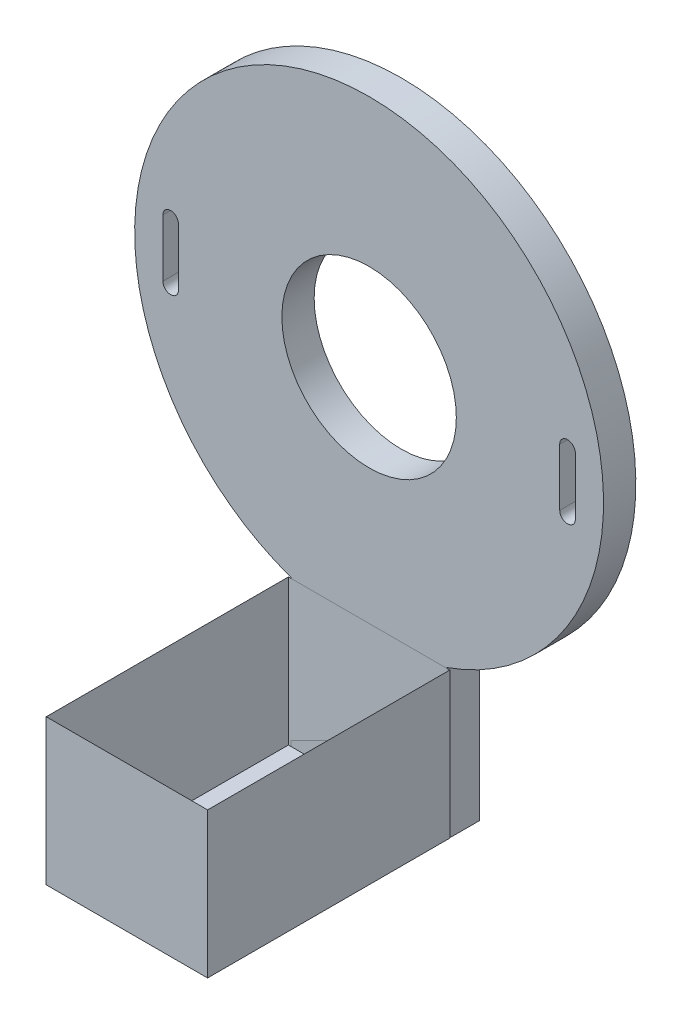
ISO-10303-21;
HEADER;
FILE_DESCRIPTION(('STEP AP214'),'2;1');
FILE_NAME('part.step','',(''),(''),'','','');
FILE_SCHEMA(('AUTOMOTIVE_DESIGN { 1 0 10303 214 1 1 1 1 }'));
ENDSEC;
DATA;
#1=APPLICATION_CONTEXT('core data for automotive mechanical design processes');
#2=APPLICATION_PROTOCOL_DEFINITION('international standard','automotive_design',2000,#1);
#3=PRODUCT_CONTEXT('',#1,'mechanical');
#4=PRODUCT('Part','Part','',(#3));
#5=PRODUCT_RELATED_PRODUCT_CATEGORY('part','',(#4));
#6=PRODUCT_DEFINITION_FORMATION('','',#4);
#7=PRODUCT_DEFINITION_CONTEXT('part definition',#1,'design');
#8=PRODUCT_DEFINITION('design','',#6,#7);
#9=PRODUCT_DEFINITION_SHAPE('','',#8);
#10=(LENGTH_UNIT() NAMED_UNIT(*) SI_UNIT(.MILLI.,.METRE.));
#11=(NAMED_UNIT(*) PLANE_ANGLE_UNIT() SI_UNIT($,.RADIAN.));
#12=(NAMED_UNIT(*) SI_UNIT($,.STERADIAN.) SOLID_ANGLE_UNIT());
#13=UNCERTAINTY_MEASURE_WITH_UNIT(LENGTH_MEASURE(1.E-05),#10,'distance_accuracy_value','');
#14=(GEOMETRIC_REPRESENTATION_CONTEXT(3) GLOBAL_UNCERTAINTY_ASSIGNED_CONTEXT((#13)) GLOBAL_UNIT_ASSIGNED_CONTEXT((#10,
#11,#12)) REPRESENTATION_CONTEXT('',''));
#15=CARTESIAN_POINT('',(0.,0.,0.));
#16=DIRECTION('',(0.,0.,1.));
#17=DIRECTION('',(1.,0.,0.));
#18=AXIS2_PLACEMENT_3D('',#15,#16,#17);
#19=CARTESIAN_POINT('',(0.,-0.00286743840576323,1.5748));
#20=DIRECTION('',(0.,0.,1.));
#21=DIRECTION('',(1.,0.,0.));
#22=AXIS2_PLACEMENT_3D('',#19,#20,#21);
#23=PLANE('',#22);
#24=CARTESIAN_POINT('',(1.27,-13.6144,1.5748));
#25=DIRECTION('',(0.,0.,-1.));
#26=DIRECTION('',(-1.,0.,0.));
#27=AXIS2_PLACEMENT_3D('',#24,#25,#26);
#28=CIRCLE('',#27,0.5461);
#29=CARTESIAN_POINT('',(0.7239,-13.6144,1.5748));
#30=VERTEX_POINT('',#29);
#31=EDGE_CURVE('P0_E155',#30,#30,#28,.T.);
#32=ORIENTED_EDGE('',*,*,#31,.T.);
#33=EDGE_LOOP('',(#32));
#34=FACE_BOUND('',#33,.T.);
#35=CARTESIAN_POINT('',(0.,0.,1.5748));
#36=DIRECTION('',(0.,0.,-1.));
#37=DIRECTION('',(-1.,0.,0.));
#38=AXIS2_PLACEMENT_3D('',#35,#36,#37);
#39=CIRCLE('',#38,4.2545);
#40=CARTESIAN_POINT('',(-4.2545,0.,1.5748));
#41=VERTEX_POINT('',#40);
#42=EDGE_CURVE('P0_E166',#41,#41,#39,.T.);
#43=ORIENTED_EDGE('',*,*,#42,.T.);
#44=EDGE_LOOP('',(#43));
#45=FACE_BOUND('',#44,.T.);
#46=DIRECTION('',(1.,0.,0.));
#47=VECTOR('',#46,1.);
#48=CARTESIAN_POINT('',(-3.81,-18.034,1.5748));
#49=LINE('',#48,#47);
#50=CARTESIAN_POINT('',(-3.81,-18.034,1.5748));
#51=VERTEX_POINT('',#50);
#52=CARTESIAN_POINT('',(3.81,-18.034,1.5748));
#53=VERTEX_POINT('',#52);
#54=EDGE_CURVE('P0_E188',#51,#53,#49,.T.);
#55=ORIENTED_EDGE('',*,*,#54,.T.);
#56=DIRECTION('',(0.,1.,0.));
#57=VECTOR('',#56,1.);
#58=CARTESIAN_POINT('',(3.81,-18.034,1.5748));
#59=LINE('',#58,#57);
#60=CARTESIAN_POINT('',(3.81,-10.7823,1.5748));
#61=VERTEX_POINT('',#60);
#62=EDGE_CURVE('P0_E172',#53,#61,#59,.T.);
#63=ORIENTED_EDGE('',*,*,#62,.T.);
#64=CARTESIAN_POINT('',(0.,-0.00286743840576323,1.5748));
#65=DIRECTION('',(0.,0.,-1.));
#66=DIRECTION('',(-1.,0.,0.));
#67=AXIS2_PLACEMENT_3D('',#64,#65,#66);
#68=CIRCLE('',#67,11.4329465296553);
#69=CARTESIAN_POINT('',(-3.81,-10.7823,1.5748));
#70=VERTEX_POINT('',#69);
#71=EDGE_CURVE('P0_E170',#70,#61,#68,.T.);
#72=ORIENTED_EDGE('',*,*,#71,.F.);
#73=DIRECTION('',(0.,1.,0.));
#74=VECTOR('',#73,1.);
#75=CARTESIAN_POINT('',(-3.81,-10.7823,1.5748));
#76=LINE('',#75,#74);
#77=EDGE_CURVE('P0_E122',#70,#51,#76,.F.);
#78=ORIENTED_EDGE('',*,*,#77,.T.);
#79=EDGE_LOOP('',(#55,#63,#72,#78));
#80=FACE_BOUND('',#79,.T.);
#81=CARTESIAN_POINT('',(-1.27,-13.6144,1.5748));
#82=DIRECTION('',(0.,0.,-1.));
#83=DIRECTION('',(-1.,0.,0.));
#84=AXIS2_PLACEMENT_3D('',#81,#82,#83);
#85=CIRCLE('',#84,0.5461);
#86=CARTESIAN_POINT('',(-1.8161,-13.6144,1.5748));
#87=VERTEX_POINT('',#86);
#88=EDGE_CURVE('P0_E20',#87,#87,#85,.T.);
#89=ORIENTED_EDGE('',*,*,#88,.T.);
#90=EDGE_LOOP('',(#89));
#91=FACE_BOUND('',#90,.T.);
#92=CARTESIAN_POINT('',(9.6774,-1.397,1.5748));
#93=DIRECTION('',(0.,0.,-1.));
#94=DIRECTION('',(-1.,0.,0.));
#95=AXIS2_PLACEMENT_3D('',#92,#93,#94);
#96=CIRCLE('',#95,0.381000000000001);
#97=CARTESIAN_POINT('',(10.0584,-1.397,1.5748));
#98=VERTEX_POINT('',#97);
#99=CARTESIAN_POINT('',(9.2964,-1.397,1.5748));
#100=VERTEX_POINT('',#99);
#101=EDGE_CURVE('P0_E163',#98,#100,#96,.T.);
#102=ORIENTED_EDGE('',*,*,#101,.T.);
#103=DIRECTION('',(0.,1.,0.));
#104=VECTOR('',#103,1.);
#105=CARTESIAN_POINT('',(9.2964,1.397,1.5748));
#106=LINE('',#105,#104);
#107=CARTESIAN_POINT('',(9.2964,1.397,1.5748));
#108=VERTEX_POINT('',#107);
#109=EDGE_CURVE('P0_E181',#100,#108,#106,.T.);
#110=ORIENTED_EDGE('',*,*,#109,.T.);
#111=CARTESIAN_POINT('',(9.6774,1.397,1.5748));
#112=DIRECTION('',(0.,0.,-1.));
#113=DIRECTION('',(-1.,0.,0.));
#114=AXIS2_PLACEMENT_3D('',#111,#112,#113);
#115=CIRCLE('',#114,0.381000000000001);
#116=CARTESIAN_POINT('',(10.0584,1.397,1.5748));
#117=VERTEX_POINT('',#116);
#118=EDGE_CURVE('P0_E159',#108,#117,#115,.T.);
#119=ORIENTED_EDGE('',*,*,#118,.T.);
#120=DIRECTION('',(0.,1.,0.));
#121=VECTOR('',#120,1.);
#122=CARTESIAN_POINT('',(10.0584,1.397,1.5748));
#123=LINE('',#122,#121);
#124=EDGE_CURVE('P0_E158',#117,#98,#123,.F.);
#125=ORIENTED_EDGE('',*,*,#124,.T.);
#126=EDGE_LOOP('',(#102,#110,#119,#125));
#127=FACE_BOUND('',#126,.T.);
#128=CARTESIAN_POINT('',(-9.6774,-1.397,1.5748));
#129=DIRECTION('',(0.,0.,-1.));
#130=DIRECTION('',(-1.,0.,0.));
#131=AXIS2_PLACEMENT_3D('',#128,#129,#130);
#132=CIRCLE('',#131,0.381000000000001);
#133=CARTESIAN_POINT('',(-9.2964,-1.397,1.5748));
#134=VERTEX_POINT('',#133);
#135=CARTESIAN_POINT('',(-10.0584,-1.397,1.5748));
#136=VERTEX_POINT('',#135);
#137=EDGE_CURVE('P0_E98',#134,#136,#132,.T.);
#138=ORIENTED_EDGE('',*,*,#137,.T.);
#139=DIRECTION('',(0.,1.,0.));
#140=VECTOR('',#139,1.);
#141=CARTESIAN_POINT('',(-10.0584,1.397,1.5748));
#142=LINE('',#141,#140);
#143=CARTESIAN_POINT('',(-10.0584,1.397,1.5748));
#144=VERTEX_POINT('',#143);
#145=EDGE_CURVE('P0_E129',#136,#144,#142,.T.);
#146=ORIENTED_EDGE('',*,*,#145,.T.);
#147=CARTESIAN_POINT('',(-9.6774,1.397,1.5748));
#148=DIRECTION('',(0.,0.,-1.));
#149=DIRECTION('',(-1.,0.,0.));
#150=AXIS2_PLACEMENT_3D('',#147,#148,#149);
#151=CIRCLE('',#150,0.381000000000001);
#152=CARTESIAN_POINT('',(-9.2964,1.397,1.5748));
#153=VERTEX_POINT('',#152);
#154=EDGE_CURVE('P0_E116',#144,#153,#151,.T.);
#155=ORIENTED_EDGE('',*,*,#154,.T.);
#156=DIRECTION('',(0.,1.,0.));
#157=VECTOR('',#156,1.);
#158=CARTESIAN_POINT('',(-9.2964,1.397,1.5748));
#159=LINE('',#158,#157);
#160=EDGE_CURVE('P0_E111',#153,#134,#159,.F.);
#161=ORIENTED_EDGE('',*,*,#160,.T.);
#162=EDGE_LOOP('',(#138,#146,#155,#161));
#163=FACE_BOUND('',#162,.T.);
#164=ADVANCED_FACE('P0_F17',(#34,#45,#80,#91,#127,#163),#23,.T.);
#165=CARTESIAN_POINT('',(-1.27,-13.6144,1.5748));
#166=DIRECTION('',(0.,0.,-1.));
#167=DIRECTION('',(-1.,0.,0.));
#168=AXIS2_PLACEMENT_3D('',#165,#166,#167);
#169=CYLINDRICAL_SURFACE('',#168,0.5461);
#170=CARTESIAN_POINT('',(-1.27,-13.6144,0.));
#171=DIRECTION('',(0.,0.,-1.));
#172=DIRECTION('',(-1.,0.,0.));
#173=AXIS2_PLACEMENT_3D('',#170,#171,#172);
#174=CIRCLE('',#173,0.5461);
#175=CARTESIAN_POINT('',(-1.8161,-13.6144,0.));
#176=VERTEX_POINT('',#175);
#177=EDGE_CURVE('P0_E152',#176,#176,#174,.T.);
#178=ORIENTED_EDGE('',*,*,#177,.T.);
#179=EDGE_LOOP('',(#178));
#180=FACE_BOUND('',#179,.T.);
#181=ORIENTED_EDGE('',*,*,#88,.F.);
#182=EDGE_LOOP('',(#181));
#183=FACE_BOUND('',#182,.T.);
#184=ADVANCED_FACE('P0_F251',(#180,#183),#169,.F.);
#185=CARTESIAN_POINT('',(-9.6774,-1.397,1.5748));
#186=DIRECTION('',(0.,0.,-1.));
#187=DIRECTION('',(-1.,0.,0.));
#188=AXIS2_PLACEMENT_3D('',#185,#186,#187);
#189=CYLINDRICAL_SURFACE('',#188,0.381000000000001);
#190=DIRECTION('',(0.,0.,1.));
#191=VECTOR('',#190,1.);
#192=CARTESIAN_POINT('',(-10.0584,-1.397,1.5748));
#193=LINE('',#192,#191);
#194=CARTESIAN_POINT('',(-10.0584,-1.397,0.));
#195=VERTEX_POINT('',#194);
#196=EDGE_CURVE('P0_E104',#195,#136,#193,.T.);
#197=ORIENTED_EDGE('',*,*,#196,.T.);
#198=ORIENTED_EDGE('',*,*,#137,.F.);
#199=DIRECTION('',(0.,0.,-1.));
#200=VECTOR('',#199,1.);
#201=CARTESIAN_POINT('',(-9.2964,-1.397,1.5748));
#202=LINE('',#201,#200);
#203=CARTESIAN_POINT('',(-9.2964,-1.397,0.));
#204=VERTEX_POINT('',#203);
#205=EDGE_CURVE('P0_E102',#134,#204,#202,.T.);
#206=ORIENTED_EDGE('',*,*,#205,.T.);
#207=CARTESIAN_POINT('',(-9.6774,-1.397,0.));
#208=DIRECTION('',(0.,0.,-1.));
#209=DIRECTION('',(-1.,0.,0.));
#210=AXIS2_PLACEMENT_3D('',#207,#208,#209);
#211=CIRCLE('',#210,0.381000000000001);
#212=EDGE_CURVE('P0_E150',#204,#195,#211,.T.);
#213=ORIENTED_EDGE('',*,*,#212,.T.);
#214=EDGE_LOOP('',(#197,#198,#206,#213));
#215=FACE_BOUND('',#214,.T.);
#216=ADVANCED_FACE('P0_F100',(#215),#189,.F.);
#217=CARTESIAN_POINT('',(-10.0584,1.397,1.5748));
#218=DIRECTION('',(-1.,0.,0.));
#219=DIRECTION('',(0.,0.,1.));
#220=AXIS2_PLACEMENT_3D('',#217,#218,#219);
#221=PLANE('',#220);
#222=ORIENTED_EDGE('',*,*,#196,.F.);
#223=DIRECTION('',(0.,1.,0.));
#224=VECTOR('',#223,1.);
#225=CARTESIAN_POINT('',(-10.0584,-0.00286743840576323,0.));
#226=LINE('',#225,#224);
#227=CARTESIAN_POINT('',(-10.0584,1.397,0.));
#228=VERTEX_POINT('',#227);
#229=EDGE_CURVE('P0_E149',#195,#228,#226,.T.);
#230=ORIENTED_EDGE('',*,*,#229,.T.);
#231=DIRECTION('',(0.,0.,-1.));
#232=VECTOR('',#231,1.);
#233=CARTESIAN_POINT('',(-10.0584,1.397,1.5748));
#234=LINE('',#233,#232);
#235=EDGE_CURVE('P0_E130',#228,#144,#234,.F.);
#236=ORIENTED_EDGE('',*,*,#235,.T.);
#237=ORIENTED_EDGE('',*,*,#145,.F.);
#238=EDGE_LOOP('',(#222,#230,#236,#237));
#239=FACE_BOUND('',#238,.T.);
#240=ADVANCED_FACE('P0_F302',(#239),#221,.F.);
#241=CARTESIAN_POINT('',(-9.6774,1.397,1.5748));
#242=DIRECTION('',(0.,0.,-1.));
#243=DIRECTION('',(-1.,0.,0.));
#244=AXIS2_PLACEMENT_3D('',#241,#242,#243);
#245=CYLINDRICAL_SURFACE('',#244,0.381000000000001);
#246=DIRECTION('',(0.,0.,-1.));
#247=VECTOR('',#246,1.);
#248=CARTESIAN_POINT('',(-9.2964,1.397,1.5748));
#249=LINE('',#248,#247);
#250=CARTESIAN_POINT('',(-9.2964,1.397,0.));
#251=VERTEX_POINT('',#250);
#252=EDGE_CURVE('P0_E115',#251,#153,#249,.F.);
#253=ORIENTED_EDGE('',*,*,#252,.T.);
#254=ORIENTED_EDGE('',*,*,#154,.F.);
#255=ORIENTED_EDGE('',*,*,#235,.F.);
#256=CARTESIAN_POINT('',(-9.6774,1.397,0.));
#257=DIRECTION('',(0.,0.,-1.));
#258=DIRECTION('',(-1.,0.,0.));
#259=AXIS2_PLACEMENT_3D('',#256,#257,#258);
#260=CIRCLE('',#259,0.381000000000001);
#261=EDGE_CURVE('P0_E146',#228,#251,#260,.T.);
#262=ORIENTED_EDGE('',*,*,#261,.T.);
#263=EDGE_LOOP('',(#253,#254,#255,#262));
#264=FACE_BOUND('',#263,.T.);
#265=ADVANCED_FACE('P0_F299',(#264),#245,.F.);
#266=CARTESIAN_POINT('',(-9.2964,1.397,1.5748));
#267=DIRECTION('',(1.,0.,0.));
#268=DIRECTION('',(0.,0.,-1.));
#269=AXIS2_PLACEMENT_3D('',#266,#267,#268);
#270=PLANE('',#269);
#271=ORIENTED_EDGE('',*,*,#252,.F.);
#272=DIRECTION('',(0.,1.,0.));
#273=VECTOR('',#272,1.);
#274=CARTESIAN_POINT('',(-9.2964,-0.00286743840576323,0.));
#275=LINE('',#274,#273);
#276=EDGE_CURVE('P0_E114',#251,#204,#275,.F.);
#277=ORIENTED_EDGE('',*,*,#276,.T.);
#278=ORIENTED_EDGE('',*,*,#205,.F.);
#279=ORIENTED_EDGE('',*,*,#160,.F.);
#280=EDGE_LOOP('',(#271,#277,#278,#279));
#281=FACE_BOUND('',#280,.T.);
#282=ADVANCED_FACE('P0_F110',(#281),#270,.F.);
#283=CARTESIAN_POINT('',(-3.81,-10.7823,1.5748));
#284=DIRECTION('',(1.,0.,0.));
#285=DIRECTION('',(0.,0.,-1.));
#286=AXIS2_PLACEMENT_3D('',#283,#284,#285);
#287=PLANE('',#286);
#288=DIRECTION('',(0.,0.,1.));
#289=VECTOR('',#288,1.);
#290=CARTESIAN_POINT('',(-3.81,-18.034,1.5748));
#291=LINE('',#290,#289);
#292=CARTESIAN_POINT('',(-3.81,-18.034,0.));
#293=VERTEX_POINT('',#292);
#294=EDGE_CURVE('P0_E191',#293,#51,#291,.T.);
#295=ORIENTED_EDGE('',*,*,#294,.T.);
#296=ORIENTED_EDGE('',*,*,#77,.F.);
#297=DIRECTION('',(0.,0.,-1.));
#298=VECTOR('',#297,1.);
#299=CARTESIAN_POINT('',(-3.81,-10.7823,1.5748));
#300=LINE('',#299,#298);
#301=CARTESIAN_POINT('',(-3.81,-10.7823,0.));
#302=VERTEX_POINT('',#301);
#303=EDGE_CURVE('P0_E119',#302,#70,#300,.F.);
#304=ORIENTED_EDGE('',*,*,#303,.F.);
#305=DIRECTION('',(0.,1.,0.));
#306=VECTOR('',#305,1.);
#307=CARTESIAN_POINT('',(-3.81,-0.00286743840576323,0.));
#308=LINE('',#307,#306);
#309=EDGE_CURVE('P0_E145',#302,#293,#308,.F.);
#310=ORIENTED_EDGE('',*,*,#309,.T.);
#311=EDGE_LOOP('',(#295,#296,#304,#310));
#312=FACE_BOUND('',#311,.T.);
#313=ADVANCED_FACE('P0_F293',(#312),#287,.F.);
#314=CARTESIAN_POINT('',(-3.81,-18.034,1.5748));
#315=DIRECTION('',(0.,1.,0.));
#316=DIRECTION('',(0.,0.,1.));
#317=AXIS2_PLACEMENT_3D('',#314,#315,#316);
#318=PLANE('',#317);
#319=DIRECTION('',(0.,0.,1.));
#320=VECTOR('',#319,1.);
#321=CARTESIAN_POINT('',(3.81,-18.034,1.5748));
#322=LINE('',#321,#320);
#323=CARTESIAN_POINT('',(3.81,-18.034,0.));
#324=VERTEX_POINT('',#323);
#325=EDGE_CURVE('P0_E185',#324,#53,#322,.T.);
#326=ORIENTED_EDGE('',*,*,#325,.T.);
#327=ORIENTED_EDGE('',*,*,#54,.F.);
#328=ORIENTED_EDGE('',*,*,#294,.F.);
#329=DIRECTION('',(1.,0.,0.));
#330=VECTOR('',#329,1.);
#331=CARTESIAN_POINT('',(0.,-18.034,0.));
#332=LINE('',#331,#330);
#333=EDGE_CURVE('P0_E207',#293,#324,#332,.T.);
#334=ORIENTED_EDGE('',*,*,#333,.T.);
#335=EDGE_LOOP('',(#326,#327,#328,#334));
#336=FACE_BOUND('',#335,.T.);
#337=ADVANCED_FACE('P0_F289',(#336),#318,.F.);
#338=CARTESIAN_POINT('',(3.81,-18.034,1.5748));
#339=DIRECTION('',(-1.,0.,0.));
#340=DIRECTION('',(0.,0.,1.));
#341=AXIS2_PLACEMENT_3D('',#338,#339,#340);
#342=PLANE('',#341);
#343=DIRECTION('',(0.,0.,-1.));
#344=VECTOR('',#343,1.);
#345=CARTESIAN_POINT('',(3.81,-10.7823,1.5748));
#346=LINE('',#345,#344);
#347=CARTESIAN_POINT('',(3.81,-10.7823,0.));
#348=VERTEX_POINT('',#347);
#349=EDGE_CURVE('P0_E169',#61,#348,#346,.T.);
#350=ORIENTED_EDGE('',*,*,#349,.F.);
#351=ORIENTED_EDGE('',*,*,#62,.F.);
#352=ORIENTED_EDGE('',*,*,#325,.F.);
#353=DIRECTION('',(0.,1.,0.));
#354=VECTOR('',#353,1.);
#355=CARTESIAN_POINT('',(3.81,-0.00286743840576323,0.));
#356=LINE('',#355,#354);
#357=EDGE_CURVE('P0_E142',#324,#348,#356,.T.);
#358=ORIENTED_EDGE('',*,*,#357,.T.);
#359=EDGE_LOOP('',(#350,#351,#352,#358));
#360=FACE_BOUND('',#359,.T.);
#361=ADVANCED_FACE('P0_F285',(#360),#342,.F.);
#362=CARTESIAN_POINT('',(0.,-0.00286743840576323,1.5748));
#363=DIRECTION('',(0.,0.,-1.));
#364=DIRECTION('',(-1.,0.,0.));
#365=AXIS2_PLACEMENT_3D('',#362,#363,#364);
#366=CYLINDRICAL_SURFACE('',#365,11.4329465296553);
#367=ORIENTED_EDGE('',*,*,#349,.T.);
#368=CARTESIAN_POINT('',(0.,-0.00286743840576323,0.));
#369=DIRECTION('',(0.,0.,-1.));
#370=DIRECTION('',(-1.,0.,0.));
#371=AXIS2_PLACEMENT_3D('',#368,#369,#370);
#372=CIRCLE('',#371,11.4329465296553);
#373=EDGE_CURVE('P0_E143',#348,#302,#372,.F.);
#374=ORIENTED_EDGE('',*,*,#373,.T.);
#375=ORIENTED_EDGE('',*,*,#303,.T.);
#376=ORIENTED_EDGE('',*,*,#71,.T.);
#377=EDGE_LOOP('',(#367,#374,#375,#376));
#378=FACE_BOUND('',#377,.T.);
#379=ADVANCED_FACE('P0_F281',(#378),#366,.T.);
#380=CARTESIAN_POINT('',(0.,0.,1.5748));
#381=DIRECTION('',(0.,0.,-1.));
#382=DIRECTION('',(-1.,0.,0.));
#383=AXIS2_PLACEMENT_3D('',#380,#381,#382);
#384=CYLINDRICAL_SURFACE('',#383,4.2545);
#385=CARTESIAN_POINT('',(0.,0.,0.));
#386=DIRECTION('',(0.,0.,-1.));
#387=DIRECTION('',(-1.,0.,0.));
#388=AXIS2_PLACEMENT_3D('',#385,#386,#387);
#389=CIRCLE('',#388,4.2545);
#390=CARTESIAN_POINT('',(-4.2545,0.,0.));
#391=VERTEX_POINT('',#390);
#392=EDGE_CURVE('P0_E139',#391,#391,#389,.T.);
#393=ORIENTED_EDGE('',*,*,#392,.T.);
#394=EDGE_LOOP('',(#393));
#395=FACE_BOUND('',#394,.T.);
#396=ORIENTED_EDGE('',*,*,#42,.F.);
#397=EDGE_LOOP('',(#396));
#398=FACE_BOUND('',#397,.T.);
#399=ADVANCED_FACE('P0_F278',(#395,#398),#384,.F.);
#400=CARTESIAN_POINT('',(9.6774,-1.397,1.5748));
#401=DIRECTION('',(0.,0.,-1.));
#402=DIRECTION('',(-1.,0.,0.));
#403=AXIS2_PLACEMENT_3D('',#400,#401,#402);
#404=CYLINDRICAL_SURFACE('',#403,0.381000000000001);
#405=DIRECTION('',(0.,0.,1.));
#406=VECTOR('',#405,1.);
#407=CARTESIAN_POINT('',(9.2964,-1.397,1.5748));
#408=LINE('',#407,#406);
#409=CARTESIAN_POINT('',(9.2964,-1.397,0.));
#410=VERTEX_POINT('',#409);
#411=EDGE_CURVE('P0_E165',#410,#100,#408,.T.);
#412=ORIENTED_EDGE('',*,*,#411,.T.);
#413=ORIENTED_EDGE('',*,*,#101,.F.);
#414=DIRECTION('',(0.,0.,-1.));
#415=VECTOR('',#414,1.);
#416=CARTESIAN_POINT('',(10.0584,-1.397,1.5748));
#417=LINE('',#416,#415);
#418=CARTESIAN_POINT('',(10.0584,-1.397,0.));
#419=VERTEX_POINT('',#418);
#420=EDGE_CURVE('P0_E161',#98,#419,#417,.T.);
#421=ORIENTED_EDGE('',*,*,#420,.T.);
#422=CARTESIAN_POINT('',(9.6774,-1.397,0.));
#423=DIRECTION('',(0.,0.,-1.));
#424=DIRECTION('',(-1.,0.,0.));
#425=AXIS2_PLACEMENT_3D('',#422,#423,#424);
#426=CIRCLE('',#425,0.381000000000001);
#427=EDGE_CURVE('P0_E136',#419,#410,#426,.T.);
#428=ORIENTED_EDGE('',*,*,#427,.T.);
#429=EDGE_LOOP('',(#412,#413,#421,#428));
#430=FACE_BOUND('',#429,.T.);
#431=ADVANCED_FACE('P0_F248',(#430),#404,.F.);
#432=CARTESIAN_POINT('',(9.2964,1.397,1.5748));
#433=DIRECTION('',(-1.,0.,0.));
#434=DIRECTION('',(0.,0.,1.));
#435=AXIS2_PLACEMENT_3D('',#432,#433,#434);
#436=PLANE('',#435);
#437=ORIENTED_EDGE('',*,*,#411,.F.);
#438=DIRECTION('',(0.,1.,0.));
#439=VECTOR('',#438,1.);
#440=CARTESIAN_POINT('',(9.2964,-0.00286743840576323,0.));
#441=LINE('',#440,#439);
#442=CARTESIAN_POINT('',(9.2964,1.397,0.));
#443=VERTEX_POINT('',#442);
#444=EDGE_CURVE('P0_E135',#410,#443,#441,.T.);
#445=ORIENTED_EDGE('',*,*,#444,.T.);
#446=DIRECTION('',(0.,0.,-1.));
#447=VECTOR('',#446,1.);
#448=CARTESIAN_POINT('',(9.2964,1.397,1.5748));
#449=LINE('',#448,#447);
#450=EDGE_CURVE('P0_E162',#443,#108,#449,.F.);
#451=ORIENTED_EDGE('',*,*,#450,.T.);
#452=ORIENTED_EDGE('',*,*,#109,.F.);
#453=EDGE_LOOP('',(#437,#445,#451,#452));
#454=FACE_BOUND('',#453,.T.);
#455=ADVANCED_FACE('P0_F246',(#454),#436,.F.);
#456=CARTESIAN_POINT('',(9.6774,1.397,1.5748));
#457=DIRECTION('',(0.,0.,-1.));
#458=DIRECTION('',(-1.,0.,0.));
#459=AXIS2_PLACEMENT_3D('',#456,#457,#458);
#460=CYLINDRICAL_SURFACE('',#459,0.381000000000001);
#461=DIRECTION('',(0.,0.,-1.));
#462=VECTOR('',#461,1.);
#463=CARTESIAN_POINT('',(10.0584,1.397,1.5748));
#464=LINE('',#463,#462);
#465=CARTESIAN_POINT('',(10.0584,1.397,0.));
#466=VERTEX_POINT('',#465);
#467=EDGE_CURVE('P0_E35',#466,#117,#464,.F.);
#468=ORIENTED_EDGE('',*,*,#467,.T.);
#469=ORIENTED_EDGE('',*,*,#118,.F.);
#470=ORIENTED_EDGE('',*,*,#450,.F.);
#471=CARTESIAN_POINT('',(9.6774,1.397,0.));
#472=DIRECTION('',(0.,0.,-1.));
#473=DIRECTION('',(-1.,0.,0.));
#474=AXIS2_PLACEMENT_3D('',#471,#472,#473);
#475=CIRCLE('',#474,0.381000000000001);
#476=EDGE_CURVE('P0_E132',#443,#466,#475,.T.);
#477=ORIENTED_EDGE('',*,*,#476,.T.);
#478=EDGE_LOOP('',(#468,#469,#470,#477));
#479=FACE_BOUND('',#478,.T.);
#480=ADVANCED_FACE('P0_F242',(#479),#460,.F.);
#481=CARTESIAN_POINT('',(10.0584,1.397,1.5748));
#482=DIRECTION('',(1.,0.,0.));
#483=DIRECTION('',(0.,0.,-1.));
#484=AXIS2_PLACEMENT_3D('',#481,#482,#483);
#485=PLANE('',#484);
#486=ORIENTED_EDGE('',*,*,#467,.F.);
#487=DIRECTION('',(0.,1.,0.));
#488=VECTOR('',#487,1.);
#489=CARTESIAN_POINT('',(10.0584,-0.00286743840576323,0.));
#490=LINE('',#489,#488);
#491=EDGE_CURVE('P0_E26',#466,#419,#490,.F.);
#492=ORIENTED_EDGE('',*,*,#491,.T.);
#493=ORIENTED_EDGE('',*,*,#420,.F.);
#494=ORIENTED_EDGE('',*,*,#124,.F.);
#495=EDGE_LOOP('',(#486,#492,#493,#494));
#496=FACE_BOUND('',#495,.T.);
#497=ADVANCED_FACE('P0_F235',(#496),#485,.F.);
#498=CARTESIAN_POINT('',(1.27,-13.6144,1.5748));
#499=DIRECTION('',(0.,0.,-1.));
#500=DIRECTION('',(-1.,0.,0.));
#501=AXIS2_PLACEMENT_3D('',#498,#499,#500);
#502=CYLINDRICAL_SURFACE('',#501,0.5461);
#503=CARTESIAN_POINT('',(1.27,-13.6144,0.));
#504=DIRECTION('',(0.,0.,-1.));
#505=DIRECTION('',(-1.,0.,0.));
#506=AXIS2_PLACEMENT_3D('',#503,#504,#505);
#507=CIRCLE('',#506,0.5461);
#508=CARTESIAN_POINT('',(0.7239,-13.6144,0.));
#509=VERTEX_POINT('',#508);
#510=EDGE_CURVE('P0_E11',#509,#509,#507,.T.);
#511=ORIENTED_EDGE('',*,*,#510,.T.);
#512=EDGE_LOOP('',(#511));
#513=FACE_BOUND('',#512,.T.);
#514=ORIENTED_EDGE('',*,*,#31,.F.);
#515=EDGE_LOOP('',(#514));
#516=FACE_BOUND('',#515,.T.);
#517=ADVANCED_FACE('P0_F260',(#513,#516),#502,.F.);
#518=CARTESIAN_POINT('',(0.,-0.00286743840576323,0.));
#519=DIRECTION('',(0.,0.,1.));
#520=DIRECTION('',(1.,0.,0.));
#521=AXIS2_PLACEMENT_3D('',#518,#519,#520);
#522=PLANE('',#521);
#523=ORIENTED_EDGE('',*,*,#510,.F.);
#524=EDGE_LOOP('',(#523));
#525=FACE_BOUND('',#524,.T.);
#526=ORIENTED_EDGE('',*,*,#476,.F.);
#527=ORIENTED_EDGE('',*,*,#444,.F.);
#528=ORIENTED_EDGE('',*,*,#427,.F.);
#529=ORIENTED_EDGE('',*,*,#491,.F.);
#530=EDGE_LOOP('',(#526,#527,#528,#529));
#531=FACE_BOUND('',#530,.T.);
#532=ORIENTED_EDGE('',*,*,#392,.F.);
#533=EDGE_LOOP('',(#532));
#534=FACE_BOUND('',#533,.T.);
#535=ORIENTED_EDGE('',*,*,#357,.F.);
#536=ORIENTED_EDGE('',*,*,#333,.F.);
#537=ORIENTED_EDGE('',*,*,#309,.F.);
#538=ORIENTED_EDGE('',*,*,#373,.F.);
#539=EDGE_LOOP('',(#535,#536,#537,#538));
#540=FACE_BOUND('',#539,.T.);
#541=ORIENTED_EDGE('',*,*,#261,.F.);
#542=ORIENTED_EDGE('',*,*,#229,.F.);
#543=ORIENTED_EDGE('',*,*,#212,.F.);
#544=ORIENTED_EDGE('',*,*,#276,.F.);
#545=EDGE_LOOP('',(#541,#542,#543,#544));
#546=FACE_BOUND('',#545,.T.);
#547=ORIENTED_EDGE('',*,*,#177,.F.);
#548=EDGE_LOOP('',(#547));
#549=FACE_BOUND('',#548,.T.);
#550=ADVANCED_FACE('P0_F238',(#525,#531,#534,#540,#546,#549),#522,.F.);
#551=CLOSED_SHELL('',(#164,#184,#216,#240,#265,#282,#313,#337,#361,#379,#399,#431,#455,#480,
#497,#517,#550));
#552=MANIFOLD_SOLID_BREP('P0_B1',#551);
#553=CARTESIAN_POINT('',(3.93446,-17.92478,13.3858));
#554=DIRECTION('',(0.,1.,0.));
#555=DIRECTION('',(-1.,0.,0.));
#556=AXIS2_PLACEMENT_3D('',#553,#554,#555);
#557=PLANE('',#556);
#558=DIRECTION('',(0.,0.,1.));
#559=VECTOR('',#558,1.);
#560=CARTESIAN_POINT('',(3.93446,-17.92478,13.3858));
#561=LINE('',#560,#559);
#562=CARTESIAN_POINT('',(3.93446,-17.92478,13.3858));
#563=VERTEX_POINT('',#562);
#564=CARTESIAN_POINT('',(3.93446,-17.92478,1.5748));
#565=VERTEX_POINT('',#564);
#566=EDGE_CURVE('P1_E24',#563,#565,#561,.F.);
#567=ORIENTED_EDGE('',*,*,#566,.T.);
#568=DIRECTION('',(-1.,0.,0.));
#569=VECTOR('',#568,1.);
#570=CARTESIAN_POINT('',(3.93446,-17.92478,1.5748));
#571=LINE('',#570,#569);
#572=CARTESIAN_POINT('',(-3.93446,-17.92478,1.5748));
#573=VERTEX_POINT('',#572);
#574=EDGE_CURVE('P1_E11',#565,#573,#571,.T.);
#575=ORIENTED_EDGE('',*,*,#574,.T.);
#576=DIRECTION('',(0.,0.,1.));
#577=VECTOR('',#576,1.);
#578=CARTESIAN_POINT('',(-3.93446,-17.92478,13.3858));
#579=LINE('',#578,#577);
#580=CARTESIAN_POINT('',(-3.93446,-17.92478,13.3858));
#581=VERTEX_POINT('',#580);
#582=EDGE_CURVE('P1_E85',#573,#581,#579,.T.);
#583=ORIENTED_EDGE('',*,*,#582,.T.);
#584=DIRECTION('',(-1.,0.,0.));
#585=VECTOR('',#584,1.);
#586=CARTESIAN_POINT('',(3.93446,-17.92478,13.3858));
#587=LINE('',#586,#585);
#588=EDGE_CURVE('P1_E66',#581,#563,#587,.F.);
#589=ORIENTED_EDGE('',*,*,#588,.T.);
#590=EDGE_LOOP('',(#567,#575,#583,#589));
#591=FACE_BOUND('',#590,.T.);
#592=ADVANCED_FACE('P1_F16',(#591),#557,.T.);
#593=CARTESIAN_POINT('',(3.93446,-10.82548,1.5748));
#594=DIRECTION('',(0.,0.,-1.));
#595=DIRECTION('',(-1.,0.,0.));
#596=AXIS2_PLACEMENT_3D('',#593,#594,#595);
#597=PLANE('',#596);
#598=ORIENTED_EDGE('',*,*,#574,.F.);
#599=DIRECTION('',(0.,1.,0.));
#600=VECTOR('',#599,1.);
#601=CARTESIAN_POINT('',(3.93446,-10.82548,1.5748));
#602=LINE('',#601,#600);
#603=CARTESIAN_POINT('',(3.93446,-10.82548,1.5748));
#604=VERTEX_POINT('',#603);
#605=EDGE_CURVE('P1_E33',#604,#565,#602,.F.);
#606=ORIENTED_EDGE('',*,*,#605,.F.);
#607=DIRECTION('',(-1.,0.,0.));
#608=VECTOR('',#607,1.);
#609=CARTESIAN_POINT('',(3.93446,-10.82548,1.5748));
#610=LINE('',#609,#608);
#611=CARTESIAN_POINT('',(-3.93446,-10.82548,1.5748));
#612=VERTEX_POINT('',#611);
#613=EDGE_CURVE('P1_E79',#612,#604,#610,.F.);
#614=ORIENTED_EDGE('',*,*,#613,.F.);
#615=DIRECTION('',(0.,1.,0.));
#616=VECTOR('',#615,1.);
#617=CARTESIAN_POINT('',(-3.93446,-10.82548,1.5748));
#618=LINE('',#617,#616);
#619=EDGE_CURVE('P1_E61',#573,#612,#618,.T.);
#620=ORIENTED_EDGE('',*,*,#619,.F.);
#621=EDGE_LOOP('',(#598,#606,#614,#620));
#622=FACE_BOUND('',#621,.T.);
#623=ADVANCED_FACE('P1_F93',(#622),#597,.F.);
#624=CARTESIAN_POINT('',(3.93446,-10.82548,13.3858));
#625=DIRECTION('',(-1.,0.,0.));
#626=DIRECTION('',(0.,-1.,0.));
#627=AXIS2_PLACEMENT_3D('',#624,#625,#626);
#628=PLANE('',#627);
#629=DIRECTION('',(0.,0.,1.));
#630=VECTOR('',#629,1.);
#631=CARTESIAN_POINT('',(3.93446,-10.82548,13.3858));
#632=LINE('',#631,#630);
#633=CARTESIAN_POINT('',(3.93446,-10.82548,13.3858));
#634=VERTEX_POINT('',#633);
#635=EDGE_CURVE('P1_E75',#634,#604,#632,.F.);
#636=ORIENTED_EDGE('',*,*,#635,.T.);
#637=ORIENTED_EDGE('',*,*,#605,.T.);
#638=ORIENTED_EDGE('',*,*,#566,.F.);
#639=DIRECTION('',(0.,-1.,0.));
#640=VECTOR('',#639,1.);
#641=CARTESIAN_POINT('',(3.93446,-10.82548,13.3858));
#642=LINE('',#641,#640);
#643=EDGE_CURVE('P1_E69',#563,#634,#642,.F.);
#644=ORIENTED_EDGE('',*,*,#643,.T.);
#645=EDGE_LOOP('',(#636,#637,#638,#644));
#646=FACE_BOUND('',#645,.T.);
#647=ADVANCED_FACE('P1_F90',(#646),#628,.T.);
#648=CARTESIAN_POINT('',(3.93446,-10.82548,13.3858));
#649=DIRECTION('',(0.,0.,-1.));
#650=DIRECTION('',(-1.,0.,0.));
#651=AXIS2_PLACEMENT_3D('',#648,#649,#650);
#652=PLANE('',#651);
#653=DIRECTION('',(0.,1.,0.));
#654=VECTOR('',#653,1.);
#655=CARTESIAN_POINT('',(-3.93446,-10.82548,13.3858));
#656=LINE('',#655,#654);
#657=CARTESIAN_POINT('',(-3.93446,-10.82548,13.3858));
#658=VERTEX_POINT('',#657);
#659=EDGE_CURVE('P1_E58',#581,#658,#656,.T.);
#660=ORIENTED_EDGE('',*,*,#659,.T.);
#661=DIRECTION('',(-1.,0.,0.));
#662=VECTOR('',#661,1.);
#663=CARTESIAN_POINT('',(3.93446,-10.82548,13.3858));
#664=LINE('',#663,#662);
#665=EDGE_CURVE('P1_E53',#658,#634,#664,.F.);
#666=ORIENTED_EDGE('',*,*,#665,.T.);
#667=ORIENTED_EDGE('',*,*,#643,.F.);
#668=ORIENTED_EDGE('',*,*,#588,.F.);
#669=EDGE_LOOP('',(#660,#666,#667,#668));
#670=FACE_BOUND('',#669,.T.);
#671=ADVANCED_FACE('P1_F64',(#670),#652,.T.);
#672=CARTESIAN_POINT('',(-3.93446,-17.92478,13.3858));
#673=DIRECTION('',(1.,0.,0.));
#674=DIRECTION('',(0.,1.,0.));
#675=AXIS2_PLACEMENT_3D('',#672,#673,#674);
#676=PLANE('',#675);
#677=ORIENTED_EDGE('',*,*,#582,.F.);
#678=ORIENTED_EDGE('',*,*,#619,.T.);
#679=DIRECTION('',(0.,0.,1.));
#680=VECTOR('',#679,1.);
#681=CARTESIAN_POINT('',(-3.93446,-10.82548,13.3858));
#682=LINE('',#681,#680);
#683=EDGE_CURVE('P1_E19',#612,#658,#682,.T.);
#684=ORIENTED_EDGE('',*,*,#683,.T.);
#685=ORIENTED_EDGE('',*,*,#659,.F.);
#686=EDGE_LOOP('',(#677,#678,#684,#685));
#687=FACE_BOUND('',#686,.T.);
#688=ADVANCED_FACE('P1_F17',(#687),#676,.T.);
#689=OPEN_SHELL('',(#592,#623,#647,#671,#688));
#690=SHELL_BASED_SURFACE_MODEL('P1_B1',(#689));
#691=ADVANCED_BREP_SHAPE_REPRESENTATION('',(#18,#552),#14);
#692=MANIFOLD_SURFACE_SHAPE_REPRESENTATION('',(#18,#690),#14);
#693=SHAPE_REPRESENTATION('',(#18),#14);
#694=SHAPE_DEFINITION_REPRESENTATION(#9,#693);
#695=SHAPE_REPRESENTATION_RELATIONSHIP('','',#693,#691);
#696=SHAPE_REPRESENTATION_RELATIONSHIP('','',#693,#692);
ENDSEC;
END-ISO-10303-21;
